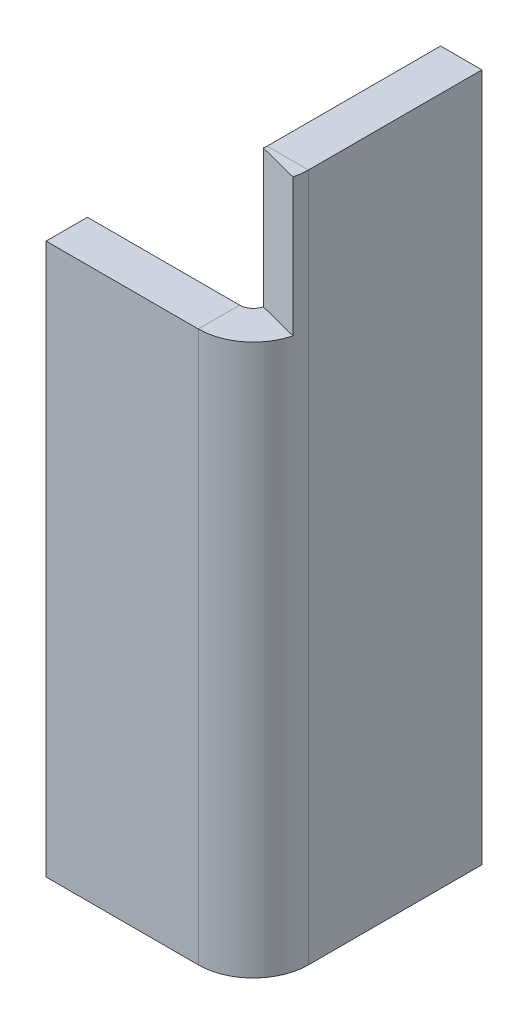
ISO-10303-21;
HEADER;
FILE_DESCRIPTION(('STEP AP214'),'2;1');
FILE_NAME('part.step','',(''),(''),'','','');
FILE_SCHEMA(('AUTOMOTIVE_DESIGN { 1 0 10303 214 1 1 1 1 }'));
ENDSEC;
DATA;
#1=APPLICATION_CONTEXT('core data for automotive mechanical design processes');
#2=APPLICATION_PROTOCOL_DEFINITION('international standard','automotive_design',2000,#1);
#3=PRODUCT_CONTEXT('',#1,'mechanical');
#4=PRODUCT('Part','Part','',(#3));
#5=PRODUCT_RELATED_PRODUCT_CATEGORY('part','',(#4));
#6=PRODUCT_DEFINITION_FORMATION('','',#4);
#7=PRODUCT_DEFINITION_CONTEXT('part definition',#1,'design');
#8=PRODUCT_DEFINITION('design','',#6,#7);
#9=PRODUCT_DEFINITION_SHAPE('','',#8);
#10=(LENGTH_UNIT() NAMED_UNIT(*) SI_UNIT(.MILLI.,.METRE.));
#11=(NAMED_UNIT(*) PLANE_ANGLE_UNIT() SI_UNIT($,.RADIAN.));
#12=(NAMED_UNIT(*) SI_UNIT($,.STERADIAN.) SOLID_ANGLE_UNIT());
#13=UNCERTAINTY_MEASURE_WITH_UNIT(LENGTH_MEASURE(1.E-05),#10,'distance_accuracy_value','');
#14=(GEOMETRIC_REPRESENTATION_CONTEXT(3) GLOBAL_UNCERTAINTY_ASSIGNED_CONTEXT((#13)) GLOBAL_UNIT_ASSIGNED_CONTEXT((#10,
#11,#12)) REPRESENTATION_CONTEXT('',''));
#15=CARTESIAN_POINT('',(0.,0.,0.));
#16=DIRECTION('',(0.,0.,1.));
#17=DIRECTION('',(1.,0.,0.));
#18=AXIS2_PLACEMENT_3D('',#15,#16,#17);
#19=CARTESIAN_POINT('',(-4.00000000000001,50.,0.));
#20=DIRECTION('',(0.,1.,0.));
#21=DIRECTION('',(0.,0.,1.));
#22=AXIS2_PLACEMENT_3D('',#19,#20,#21);
#23=PLANE('',#22);
#24=CARTESIAN_POINT('',(-4.,50.,-4.));
#25=DIRECTION('',(0.,1.,0.));
#26=DIRECTION('',(1.,0.,0.));
#27=AXIS2_PLACEMENT_3D('',#24,#25,#26);
#28=CIRCLE('',#27,1.);
#29=CARTESIAN_POINT('',(-3.03175416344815,50.,-3.75));
#30=VERTEX_POINT('',#29);
#31=CARTESIAN_POINT('',(-3.,50.,-4.));
#32=VERTEX_POINT('',#31);
#33=EDGE_CURVE('E162',#30,#32,#28,.T.);
#34=ORIENTED_EDGE('',*,*,#33,.F.);
#35=DIRECTION('',(0.968245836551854,0.,0.25));
#36=VECTOR('',#35,1.);
#37=CARTESIAN_POINT('',(-0.127016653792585,50.,-3.));
#38=LINE('',#37,#36);
#39=CARTESIAN_POINT('',(-0.127016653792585,50.,-3.));
#40=VERTEX_POINT('',#39);
#41=EDGE_CURVE('E119',#40,#30,#38,.F.);
#42=ORIENTED_EDGE('',*,*,#41,.F.);
#43=CARTESIAN_POINT('',(-4.,50.,-4.));
#44=DIRECTION('',(0.,-1.,0.));
#45=DIRECTION('',(0.,0.,-1.));
#46=AXIS2_PLACEMENT_3D('',#43,#44,#45);
#47=CIRCLE('',#46,4.);
#48=CARTESIAN_POINT('',(0.,50.,-4.));
#49=VERTEX_POINT('',#48);
#50=EDGE_CURVE('E56',#40,#49,#47,.F.);
#51=ORIENTED_EDGE('',*,*,#50,.T.);
#52=DIRECTION('',(1.,0.,0.));
#53=VECTOR('',#52,1.);
#54=CARTESIAN_POINT('',(-3.,50.,-4.));
#55=LINE('',#54,#53);
#56=EDGE_CURVE('E11',#32,#49,#55,.T.);
#57=ORIENTED_EDGE('',*,*,#56,.F.);
#58=EDGE_LOOP('',(#34,#42,#51,#57));
#59=FACE_BOUND('',#58,.T.);
#60=ADVANCED_FACE('F33',(#59),#23,.T.);
#61=CARTESIAN_POINT('',(-4.,50.,-4.));
#62=DIRECTION('',(0.,-1.,0.));
#63=DIRECTION('',(0.,0.,-1.));
#64=AXIS2_PLACEMENT_3D('',#61,#62,#63);
#65=CYLINDRICAL_SURFACE('',#64,1.);
#66=DIRECTION('',(0.,-1.,0.));
#67=VECTOR('',#66,1.);
#68=CARTESIAN_POINT('',(-4.,50.,-3.));
#69=LINE('',#68,#67);
#70=CARTESIAN_POINT('',(-4.00000000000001,40.,-3.));
#71=VERTEX_POINT('',#70);
#72=CARTESIAN_POINT('',(-4.,0.,-3.));
#73=VERTEX_POINT('',#72);
#74=EDGE_CURVE('E136',#71,#73,#69,.T.);
#75=ORIENTED_EDGE('',*,*,#74,.F.);
#76=CARTESIAN_POINT('',(-4.,40.,-4.));
#77=DIRECTION('',(0.,-1.,0.));
#78=DIRECTION('',(0.,0.,-1.));
#79=AXIS2_PLACEMENT_3D('',#76,#77,#78);
#80=CIRCLE('',#79,1.);
#81=CARTESIAN_POINT('',(-3.03175416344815,40.,-3.75));
#82=VERTEX_POINT('',#81);
#83=EDGE_CURVE('E123',#71,#82,#80,.F.);
#84=ORIENTED_EDGE('',*,*,#83,.T.);
#85=DIRECTION('',(0.,-1.,0.));
#86=VECTOR('',#85,1.);
#87=CARTESIAN_POINT('',(-3.03175416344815,50.,-3.75));
#88=LINE('',#87,#86);
#89=EDGE_CURVE('E117',#30,#82,#88,.T.);
#90=ORIENTED_EDGE('',*,*,#89,.F.);
#91=ORIENTED_EDGE('',*,*,#33,.T.);
#92=DIRECTION('',(0.,-1.,0.));
#93=VECTOR('',#92,1.);
#94=CARTESIAN_POINT('',(-3.,50.,-4.));
#95=LINE('',#94,#93);
#96=CARTESIAN_POINT('',(-3.,0.,-4.));
#97=VERTEX_POINT('',#96);
#98=EDGE_CURVE('E195',#32,#97,#95,.T.);
#99=ORIENTED_EDGE('',*,*,#98,.T.);
#100=CARTESIAN_POINT('',(-4.,0.,-4.));
#101=DIRECTION('',(0.,1.,0.));
#102=DIRECTION('',(1.,0.,0.));
#103=AXIS2_PLACEMENT_3D('',#100,#101,#102);
#104=CIRCLE('',#103,1.);
#105=EDGE_CURVE('E174',#73,#97,#104,.T.);
#106=ORIENTED_EDGE('',*,*,#105,.F.);
#107=EDGE_LOOP('',(#75,#84,#90,#91,#99,#106));
#108=FACE_BOUND('',#107,.T.);
#109=ADVANCED_FACE('F134',(#108),#65,.F.);
#110=CARTESIAN_POINT('',(-15.0545025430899,50.,-3.));
#111=DIRECTION('',(0.,0.,-1.));
#112=DIRECTION('',(-1.,0.,0.));
#113=AXIS2_PLACEMENT_3D('',#110,#111,#112);
#114=PLANE('',#113);
#115=DIRECTION('',(0.,-1.,0.));
#116=VECTOR('',#115,1.);
#117=CARTESIAN_POINT('',(-15.0545025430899,50.,-3.));
#118=LINE('',#117,#116);
#119=CARTESIAN_POINT('',(-15.0545025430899,40.,-3.));
#120=VERTEX_POINT('',#119);
#121=CARTESIAN_POINT('',(-15.0545025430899,0.,-3.));
#122=VERTEX_POINT('',#121);
#123=EDGE_CURVE('E192',#120,#122,#118,.T.);
#124=ORIENTED_EDGE('',*,*,#123,.F.);
#125=DIRECTION('',(-1.,0.,0.));
#126=VECTOR('',#125,1.);
#127=CARTESIAN_POINT('',(-15.0545025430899,40.,-3.));
#128=LINE('',#127,#126);
#129=EDGE_CURVE('E143',#120,#71,#128,.F.);
#130=ORIENTED_EDGE('',*,*,#129,.T.);
#131=ORIENTED_EDGE('',*,*,#74,.T.);
#132=DIRECTION('',(1.,0.,0.));
#133=VECTOR('',#132,1.);
#134=CARTESIAN_POINT('',(-15.0545025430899,0.,-3.));
#135=LINE('',#134,#133);
#136=EDGE_CURVE('E176',#122,#73,#135,.T.);
#137=ORIENTED_EDGE('',*,*,#136,.F.);
#138=EDGE_LOOP('',(#124,#130,#131,#137));
#139=FACE_BOUND('',#138,.T.);
#140=ADVANCED_FACE('F229',(#139),#114,.T.);
#141=CARTESIAN_POINT('',(-15.0545025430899,50.,0.));
#142=DIRECTION('',(-1.,0.,0.));
#143=DIRECTION('',(0.,0.,1.));
#144=AXIS2_PLACEMENT_3D('',#141,#142,#143);
#145=PLANE('',#144);
#146=DIRECTION('',(0.,-1.,0.));
#147=VECTOR('',#146,1.);
#148=CARTESIAN_POINT('',(-15.0545025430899,50.,0.));
#149=LINE('',#148,#147);
#150=CARTESIAN_POINT('',(-15.0545025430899,40.,0.));
#151=VERTEX_POINT('',#150);
#152=CARTESIAN_POINT('',(-15.0545025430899,0.,0.));
#153=VERTEX_POINT('',#152);
#154=EDGE_CURVE('E190',#151,#153,#149,.T.);
#155=ORIENTED_EDGE('',*,*,#154,.F.);
#156=DIRECTION('',(0.,0.,1.));
#157=VECTOR('',#156,1.);
#158=CARTESIAN_POINT('',(-15.0545025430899,40.,0.));
#159=LINE('',#158,#157);
#160=EDGE_CURVE('E146',#151,#120,#159,.F.);
#161=ORIENTED_EDGE('',*,*,#160,.T.);
#162=ORIENTED_EDGE('',*,*,#123,.T.);
#163=DIRECTION('',(0.,0.,-1.));
#164=VECTOR('',#163,1.);
#165=CARTESIAN_POINT('',(-15.0545025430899,0.,0.));
#166=LINE('',#165,#164);
#167=EDGE_CURVE('E179',#153,#122,#166,.T.);
#168=ORIENTED_EDGE('',*,*,#167,.F.);
#169=EDGE_LOOP('',(#155,#161,#162,#168));
#170=FACE_BOUND('',#169,.T.);
#171=ADVANCED_FACE('F226',(#170),#145,.T.);
#172=CARTESIAN_POINT('',(-15.0545025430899,50.,0.));
#173=DIRECTION('',(0.,0.,-1.));
#174=DIRECTION('',(-1.,0.,0.));
#175=AXIS2_PLACEMENT_3D('',#172,#173,#174);
#176=PLANE('',#175);
#177=DIRECTION('',(1.,0.,0.));
#178=VECTOR('',#177,1.);
#179=CARTESIAN_POINT('',(-15.0545025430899,40.,0.));
#180=LINE('',#179,#178);
#181=CARTESIAN_POINT('',(-4.00000000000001,40.,0.));
#182=VERTEX_POINT('',#181);
#183=EDGE_CURVE('E131',#151,#182,#180,.T.);
#184=ORIENTED_EDGE('',*,*,#183,.F.);
#185=ORIENTED_EDGE('',*,*,#154,.T.);
#186=DIRECTION('',(1.,0.,0.));
#187=VECTOR('',#186,1.);
#188=CARTESIAN_POINT('',(-15.0545025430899,0.,0.));
#189=LINE('',#188,#187);
#190=CARTESIAN_POINT('',(-4.00000000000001,0.,0.));
#191=VERTEX_POINT('',#190);
#192=EDGE_CURVE('E182',#153,#191,#189,.T.);
#193=ORIENTED_EDGE('',*,*,#192,.T.);
#194=DIRECTION('',(0.,-1.,0.));
#195=VECTOR('',#194,1.);
#196=CARTESIAN_POINT('',(-4.00000000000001,50.,0.));
#197=LINE('',#196,#195);
#198=EDGE_CURVE('E188',#182,#191,#197,.T.);
#199=ORIENTED_EDGE('',*,*,#198,.F.);
#200=EDGE_LOOP('',(#184,#185,#193,#199));
#201=FACE_BOUND('',#200,.T.);
#202=ADVANCED_FACE('F223',(#201),#176,.F.);
#203=CARTESIAN_POINT('',(-4.,50.,-4.));
#204=DIRECTION('',(0.,-1.,0.));
#205=DIRECTION('',(0.,0.,-1.));
#206=AXIS2_PLACEMENT_3D('',#203,#204,#205);
#207=CYLINDRICAL_SURFACE('',#206,4.);
#208=CARTESIAN_POINT('',(-4.,40.,-4.));
#209=DIRECTION('',(0.,1.,0.));
#210=DIRECTION('',(0.,0.,1.));
#211=AXIS2_PLACEMENT_3D('',#208,#209,#210);
#212=CIRCLE('',#211,4.);
#213=CARTESIAN_POINT('',(-0.127016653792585,40.,-3.));
#214=VERTEX_POINT('',#213);
#215=EDGE_CURVE('E124',#182,#214,#212,.T.);
#216=ORIENTED_EDGE('',*,*,#215,.F.);
#217=ORIENTED_EDGE('',*,*,#198,.T.);
#218=CARTESIAN_POINT('',(-4.,0.,-4.));
#219=DIRECTION('',(0.,-1.,0.));
#220=DIRECTION('',(0.,0.,-1.));
#221=AXIS2_PLACEMENT_3D('',#218,#219,#220);
#222=CIRCLE('',#221,4.);
#223=CARTESIAN_POINT('',(0.,0.,-4.));
#224=VERTEX_POINT('',#223);
#225=EDGE_CURVE('E156',#191,#224,#222,.F.);
#226=ORIENTED_EDGE('',*,*,#225,.T.);
#227=DIRECTION('',(0.,-1.,0.));
#228=VECTOR('',#227,1.);
#229=CARTESIAN_POINT('',(0.,50.,-4.));
#230=LINE('',#229,#228);
#231=EDGE_CURVE('E165',#49,#224,#230,.T.);
#232=ORIENTED_EDGE('',*,*,#231,.F.);
#233=ORIENTED_EDGE('',*,*,#50,.F.);
#234=DIRECTION('',(0.,-1.,0.));
#235=VECTOR('',#234,1.);
#236=CARTESIAN_POINT('',(-0.127016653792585,50.,-3.));
#237=LINE('',#236,#235);
#238=EDGE_CURVE('E140',#40,#214,#237,.T.);
#239=ORIENTED_EDGE('',*,*,#238,.T.);
#240=EDGE_LOOP('',(#216,#217,#226,#232,#233,#239));
#241=FACE_BOUND('',#240,.T.);
#242=ADVANCED_FACE('F233',(#241),#207,.T.);
#243=CARTESIAN_POINT('',(0.,0.,-4.));
#244=DIRECTION('',(0.,-1.,0.));
#245=DIRECTION('',(0.,0.,-1.));
#246=AXIS2_PLACEMENT_3D('',#243,#244,#245);
#247=PLANE('',#246);
#248=DIRECTION('',(-1.,0.,0.));
#249=VECTOR('',#248,1.);
#250=CARTESIAN_POINT('',(0.,0.,-4.));
#251=LINE('',#250,#249);
#252=EDGE_CURVE('E40',#224,#97,#251,.T.);
#253=ORIENTED_EDGE('',*,*,#252,.F.);
#254=ORIENTED_EDGE('',*,*,#225,.F.);
#255=DIRECTION('',(0.,0.,1.));
#256=VECTOR('',#255,1.);
#257=CARTESIAN_POINT('',(-4.,0.,-3.));
#258=LINE('',#257,#256);
#259=EDGE_CURVE('E202',#73,#191,#258,.T.);
#260=ORIENTED_EDGE('',*,*,#259,.F.);
#261=ORIENTED_EDGE('',*,*,#105,.T.);
#262=EDGE_LOOP('',(#253,#254,#260,#261));
#263=FACE_BOUND('',#262,.T.);
#264=ADVANCED_FACE('F214',(#263),#247,.T.);
#265=CARTESIAN_POINT('',(-4.,0.,-3.));
#266=DIRECTION('',(0.,-1.,0.));
#267=DIRECTION('',(0.,0.,-1.));
#268=AXIS2_PLACEMENT_3D('',#265,#266,#267);
#269=PLANE('',#268);
#270=DIRECTION('',(0.,0.,-1.));
#271=VECTOR('',#270,1.);
#272=CARTESIAN_POINT('',(0.,0.,0.));
#273=LINE('',#272,#271);
#274=CARTESIAN_POINT('',(0.,0.,-16.5954863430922));
#275=VERTEX_POINT('',#274);
#276=EDGE_CURVE('E151',#224,#275,#273,.T.);
#277=ORIENTED_EDGE('',*,*,#276,.F.);
#278=ORIENTED_EDGE('',*,*,#252,.T.);
#279=DIRECTION('',(0.,0.,-1.));
#280=VECTOR('',#279,1.);
#281=CARTESIAN_POINT('',(-3.,0.,0.));
#282=LINE('',#281,#280);
#283=CARTESIAN_POINT('',(-3.,0.,-16.5954863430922));
#284=VERTEX_POINT('',#283);
#285=EDGE_CURVE('E171',#97,#284,#282,.T.);
#286=ORIENTED_EDGE('',*,*,#285,.T.);
#287=DIRECTION('',(1.,0.,0.));
#288=VECTOR('',#287,1.);
#289=CARTESIAN_POINT('',(-3.,0.,-16.5954863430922));
#290=LINE('',#289,#288);
#291=EDGE_CURVE('E168',#284,#275,#290,.T.);
#292=ORIENTED_EDGE('',*,*,#291,.T.);
#293=EDGE_LOOP('',(#277,#278,#286,#292));
#294=FACE_BOUND('',#293,.T.);
#295=ADVANCED_FACE('F206',(#294),#269,.T.);
#296=CARTESIAN_POINT('',(0.,50.,0.));
#297=DIRECTION('',(-1.,0.,0.));
#298=DIRECTION('',(0.,0.,1.));
#299=AXIS2_PLACEMENT_3D('',#296,#297,#298);
#300=PLANE('',#299);
#301=ORIENTED_EDGE('',*,*,#276,.T.);
#302=DIRECTION('',(0.,-1.,0.));
#303=VECTOR('',#302,1.);
#304=CARTESIAN_POINT('',(0.,50.,-16.5954863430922));
#305=LINE('',#304,#303);
#306=CARTESIAN_POINT('',(0.,50.,-16.5954863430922));
#307=VERTEX_POINT('',#306);
#308=EDGE_CURVE('E200',#307,#275,#305,.T.);
#309=ORIENTED_EDGE('',*,*,#308,.F.);
#310=DIRECTION('',(0.,0.,-1.));
#311=VECTOR('',#310,1.);
#312=CARTESIAN_POINT('',(0.,50.,0.));
#313=LINE('',#312,#311);
#314=EDGE_CURVE('E95',#49,#307,#313,.T.);
#315=ORIENTED_EDGE('',*,*,#314,.F.);
#316=ORIENTED_EDGE('',*,*,#231,.T.);
#317=EDGE_LOOP('',(#301,#309,#315,#316));
#318=FACE_BOUND('',#317,.T.);
#319=ADVANCED_FACE('F237',(#318),#300,.F.);
#320=CARTESIAN_POINT('',(-3.,50.,-16.5954863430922));
#321=DIRECTION('',(0.,0.,-1.));
#322=DIRECTION('',(-1.,0.,0.));
#323=AXIS2_PLACEMENT_3D('',#320,#321,#322);
#324=PLANE('',#323);
#325=ORIENTED_EDGE('',*,*,#291,.F.);
#326=DIRECTION('',(0.,-1.,0.));
#327=VECTOR('',#326,1.);
#328=CARTESIAN_POINT('',(-3.,50.,-16.5954863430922));
#329=LINE('',#328,#327);
#330=CARTESIAN_POINT('',(-3.,50.,-16.5954863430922));
#331=VERTEX_POINT('',#330);
#332=EDGE_CURVE('E198',#331,#284,#329,.T.);
#333=ORIENTED_EDGE('',*,*,#332,.F.);
#334=DIRECTION('',(1.,0.,0.));
#335=VECTOR('',#334,1.);
#336=CARTESIAN_POINT('',(-3.,50.,-16.5954863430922));
#337=LINE('',#336,#335);
#338=EDGE_CURVE('E155',#331,#307,#337,.T.);
#339=ORIENTED_EDGE('',*,*,#338,.T.);
#340=ORIENTED_EDGE('',*,*,#308,.T.);
#341=EDGE_LOOP('',(#325,#333,#339,#340));
#342=FACE_BOUND('',#341,.T.);
#343=ADVANCED_FACE('F239',(#342),#324,.T.);
#344=CARTESIAN_POINT('',(-3.,50.,0.));
#345=DIRECTION('',(-1.,0.,0.));
#346=DIRECTION('',(0.,0.,1.));
#347=AXIS2_PLACEMENT_3D('',#344,#345,#346);
#348=PLANE('',#347);
#349=ORIENTED_EDGE('',*,*,#285,.F.);
#350=ORIENTED_EDGE('',*,*,#98,.F.);
#351=DIRECTION('',(0.,0.,-1.));
#352=VECTOR('',#351,1.);
#353=CARTESIAN_POINT('',(-3.,50.,0.));
#354=LINE('',#353,#352);
#355=EDGE_CURVE('E159',#32,#331,#354,.T.);
#356=ORIENTED_EDGE('',*,*,#355,.T.);
#357=ORIENTED_EDGE('',*,*,#332,.T.);
#358=EDGE_LOOP('',(#349,#350,#356,#357));
#359=FACE_BOUND('',#358,.T.);
#360=ADVANCED_FACE('F211',(#359),#348,.T.);
#361=CARTESIAN_POINT('',(-4.,50.,-4.));
#362=DIRECTION('',(0.,1.,0.));
#363=DIRECTION('',(0.,0.,1.));
#364=AXIS2_PLACEMENT_3D('',#361,#362,#363);
#365=PLANE('',#364);
#366=ORIENTED_EDGE('',*,*,#314,.T.);
#367=ORIENTED_EDGE('',*,*,#338,.F.);
#368=ORIENTED_EDGE('',*,*,#355,.F.);
#369=ORIENTED_EDGE('',*,*,#56,.T.);
#370=EDGE_LOOP('',(#366,#367,#368,#369));
#371=FACE_BOUND('',#370,.T.);
#372=ADVANCED_FACE('F235',(#371),#365,.T.);
#373=CARTESIAN_POINT('',(-4.,0.,-4.));
#374=DIRECTION('',(0.,1.,0.));
#375=DIRECTION('',(0.,0.,1.));
#376=AXIS2_PLACEMENT_3D('',#373,#374,#375);
#377=PLANE('',#376);
#378=ORIENTED_EDGE('',*,*,#136,.T.);
#379=ORIENTED_EDGE('',*,*,#259,.T.);
#380=ORIENTED_EDGE('',*,*,#192,.F.);
#381=ORIENTED_EDGE('',*,*,#167,.T.);
#382=EDGE_LOOP('',(#378,#379,#380,#381));
#383=FACE_BOUND('',#382,.T.);
#384=ADVANCED_FACE('F217',(#383),#377,.F.);
#385=CARTESIAN_POINT('',(-15.0545025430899,40.,0.));
#386=DIRECTION('',(0.,1.,0.));
#387=DIRECTION('',(1.,0.,0.));
#388=AXIS2_PLACEMENT_3D('',#385,#386,#387);
#389=PLANE('',#388);
#390=ORIENTED_EDGE('',*,*,#183,.T.);
#391=DIRECTION('',(0.,0.,1.));
#392=VECTOR('',#391,1.);
#393=CARTESIAN_POINT('',(-4.00000000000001,40.,0.));
#394=LINE('',#393,#392);
#395=EDGE_CURVE('E149',#182,#71,#394,.F.);
#396=ORIENTED_EDGE('',*,*,#395,.T.);
#397=ORIENTED_EDGE('',*,*,#129,.F.);
#398=ORIENTED_EDGE('',*,*,#160,.F.);
#399=EDGE_LOOP('',(#390,#396,#397,#398));
#400=FACE_BOUND('',#399,.T.);
#401=ADVANCED_FACE('F231',(#400),#389,.T.);
#402=CARTESIAN_POINT('',(-4.,40.,-4.));
#403=DIRECTION('',(0.,-1.,0.));
#404=DIRECTION('',(0.,0.,-1.));
#405=AXIS2_PLACEMENT_3D('',#402,#403,#404);
#406=PLANE('',#405);
#407=ORIENTED_EDGE('',*,*,#395,.F.);
#408=ORIENTED_EDGE('',*,*,#215,.T.);
#409=DIRECTION('',(0.968245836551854,0.,0.25));
#410=VECTOR('',#409,1.);
#411=CARTESIAN_POINT('',(-0.127016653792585,40.,-3.));
#412=LINE('',#411,#410);
#413=EDGE_CURVE('E47',#214,#82,#412,.F.);
#414=ORIENTED_EDGE('',*,*,#413,.T.);
#415=ORIENTED_EDGE('',*,*,#83,.F.);
#416=EDGE_LOOP('',(#407,#408,#414,#415));
#417=FACE_BOUND('',#416,.T.);
#418=ADVANCED_FACE('F127',(#417),#406,.F.);
#419=CARTESIAN_POINT('',(-0.127016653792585,45.,-3.));
#420=DIRECTION('',(-0.25,0.,0.968245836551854));
#421=DIRECTION('',(0.,-1.,0.));
#422=AXIS2_PLACEMENT_3D('',#419,#420,#421);
#423=PLANE('',#422);
#424=ORIENTED_EDGE('',*,*,#413,.F.);
#425=ORIENTED_EDGE('',*,*,#238,.F.);
#426=ORIENTED_EDGE('',*,*,#41,.T.);
#427=ORIENTED_EDGE('',*,*,#89,.T.);
#428=EDGE_LOOP('',(#424,#425,#426,#427));
#429=FACE_BOUND('',#428,.T.);
#430=ADVANCED_FACE('F118',(#429),#423,.T.);
#431=CLOSED_SHELL('',(#60,#109,#140,#171,#202,#242,#264,#295,#319,#343,#360,#372,#384,#401,#418,#430));
#432=MANIFOLD_SOLID_BREP('B2',#431);
#433=ADVANCED_BREP_SHAPE_REPRESENTATION('',(#18,#432),#14);
#434=SHAPE_DEFINITION_REPRESENTATION(#9,#433);
ENDSEC;
END-ISO-10303-21;
